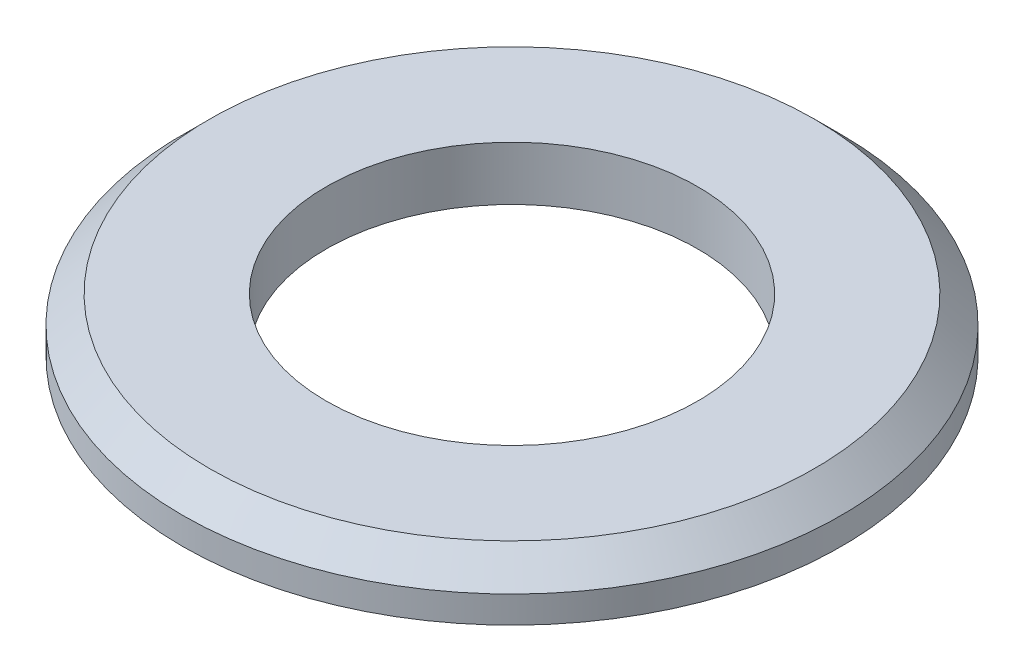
from build123d import *

# Parameters (mm, degrees)
SKETCH1_R      = 55
SKETCH1_R_2    = 31
EXTRUDE1_DEPTH = 9
CHAMFER1_SIZE  = 4.5


with BuildPart() as part:
    # Sketch1 → Extrude1 (new body)
    with BuildSketch(Plane(origin=(0, 0, 0), x_dir=(1, 0, 0), z_dir=(0, 1, 0))):
        with Locations(Location((0, 0, 0), (0, 0, 270))):
            Circle(SKETCH1_R)
        with Locations(Location((0, 0, 0), (0, 0, 270))):
            Circle(SKETCH1_R_2, mode=Mode.SUBTRACT)
    extrude(amount=EXTRUDE1_DEPTH)

    # Chamfer1
    chamfer1_edges = [part.edges().sort_by_distance(p)[0] for p in [
        (0, 9, -55),
    ]]
    chamfer(chamfer1_edges, length=CHAMFER1_SIZE)


solid = part.part
